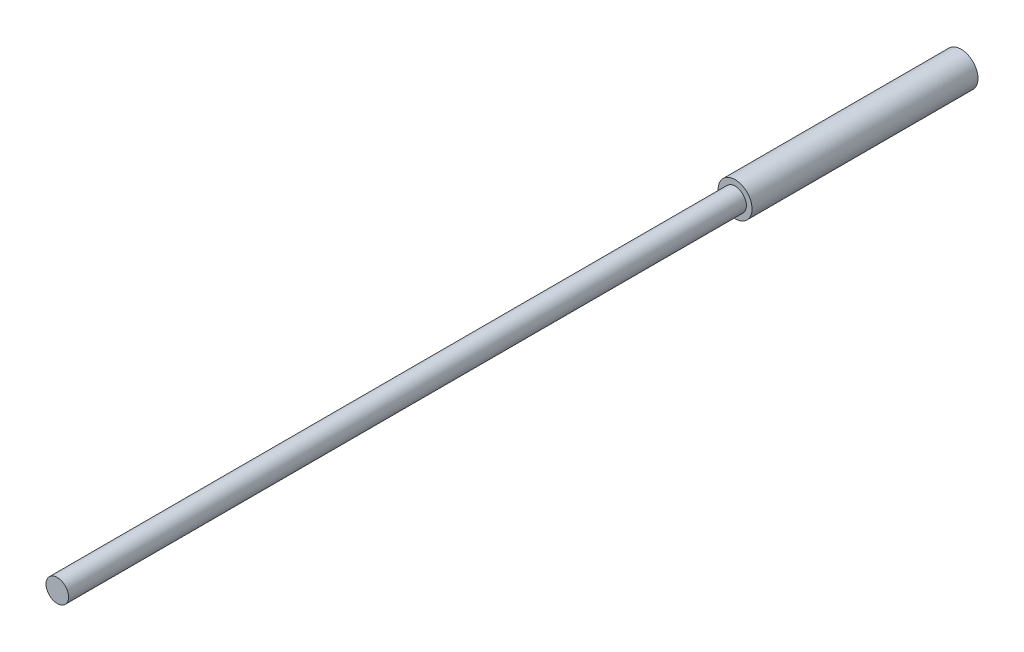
from build123d import *

# Parameters (mm, degrees)
SKETCH_1_R          = 0.75
EXTRUDE_1_DEPTH     = 10
SKETCH_2_R          = 0.5
EXTRUDE_2_DEPTH     = 30
SKETCH_3_R          = 0.1375
SKETCH_3_R_2        = 0.1325
CUT_EXTRUDE_1_DEPTH = 0.1


with BuildPart() as part:
    # Sketch 1 → Extrude 1 (new body)
    with BuildSketch(Plane.XY):
        Circle(SKETCH_1_R)
    extrude(amount=EXTRUDE_1_DEPTH)

    # Sketch 2 → Extrude 2 (add)
    with BuildSketch(Plane.XY.offset(10)):
        Circle(SKETCH_2_R)
    extrude(amount=EXTRUDE_2_DEPTH)

    # Sketch 3 → Cut-Extrude 1 (cut)
    # profile 1 of 4: a face of its own
    with BuildSketch(Plane(origin=(0, 0, 0), x_dir=(-1, 0, 0), z_dir=(0, 0, -1))):
        with Locations((0, 0.201525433)):
            Circle(SKETCH_3_R)
        with Locations((0, 0.201525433)):
            Circle(SKETCH_3_R_2, mode=Mode.SUBTRACT)
    # profile 2 of 4: a face of its own
    with BuildSketch(Plane(origin=(0, 0, 0), x_dir=(-1, 0, 0), z_dir=(0, 0, -1))):
        with Locations((0.201525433, 0)):
            Circle(SKETCH_3_R)
        with Locations((0.201525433, 0)):
            Circle(SKETCH_3_R_2, mode=Mode.SUBTRACT)
    # profile 3 of 4: a face of its own
    with BuildSketch(Plane(origin=(0, 0, 0), x_dir=(-1, 0, 0), z_dir=(0, 0, -1))):
        with Locations((0, -0.201525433)):
            Circle(SKETCH_3_R)
        with Locations((0, -0.201525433)):
            Circle(SKETCH_3_R_2, mode=Mode.SUBTRACT)
    # profile 4 of 4: a face of its own
    with BuildSketch(Plane(origin=(0, 0, 0), x_dir=(-1, 0, 0), z_dir=(0, 0, -1))):
        with Locations((-0.201525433, 0)):
            Circle(SKETCH_3_R)
        with Locations((-0.201525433, 0)):
            Circle(SKETCH_3_R_2, mode=Mode.SUBTRACT)
    extrude(amount=-CUT_EXTRUDE_1_DEPTH, mode=Mode.SUBTRACT)


solid = part.part
